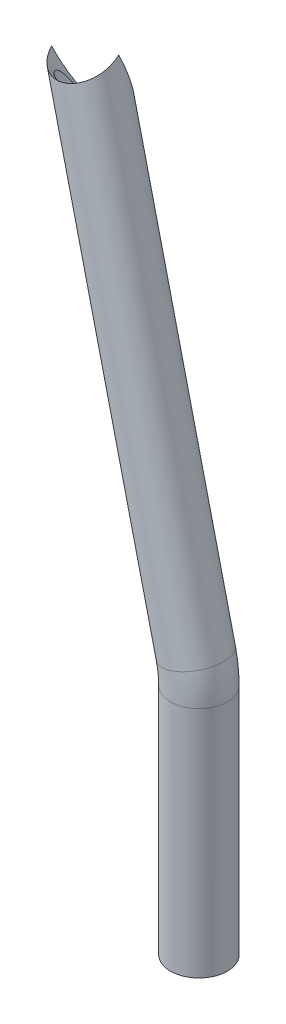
from build123d import *

# Parameters (mm, degrees)
ESQUISSE2_R   = 15
ESQUISSE2_R_2 = 13
ESQUISSE3_W   = 15
ESQUISSE3_H   = 70


with BuildPart() as part:
    # Balayage1: sweep along a path in Esquisse1
    with BuildLine(Plane.XY) as balayage1_path:
        Line((0, 0), (58.380510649, -246.153846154))
        ThreePointArc((58.380510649, -246.153846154), (59.593752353, -253.029728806), (60, -260))
        Line((60, -260), (60, -382.982212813))
    # Esquisse2 → Balayage1 (sweep)
    with BuildSketch(Plane(origin=(0, -382.982212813, 0), x_dir=(-1, 0, 0), z_dir=(0, 1, 0))):
        with Locations((-60, 0)):
            Circle(ESQUISSE2_R)
        with Locations((-60, 0)):
            Circle(ESQUISSE2_R_2, mode=Mode.SUBTRACT)
    sweep(path=balayage1_path.line)

    # Esquisse3 → Enl_vement de mati_re-R_volution1 (revolve, cut)
    with BuildSketch(Plane(origin=(0, 0, 0), x_dir=(-1, 0, 0), z_dir=(0, 0.6943872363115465, -0.7196015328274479))):
        with Locations((7.5, -5)):
            Rectangle(ESQUISSE3_W, ESQUISSE3_H)
    revolve(axis=Axis((0, 28.722803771, 27.716378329), (0, -0.7196015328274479, -0.6943872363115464)), mode=Mode.SUBTRACT)


solid = part.part
